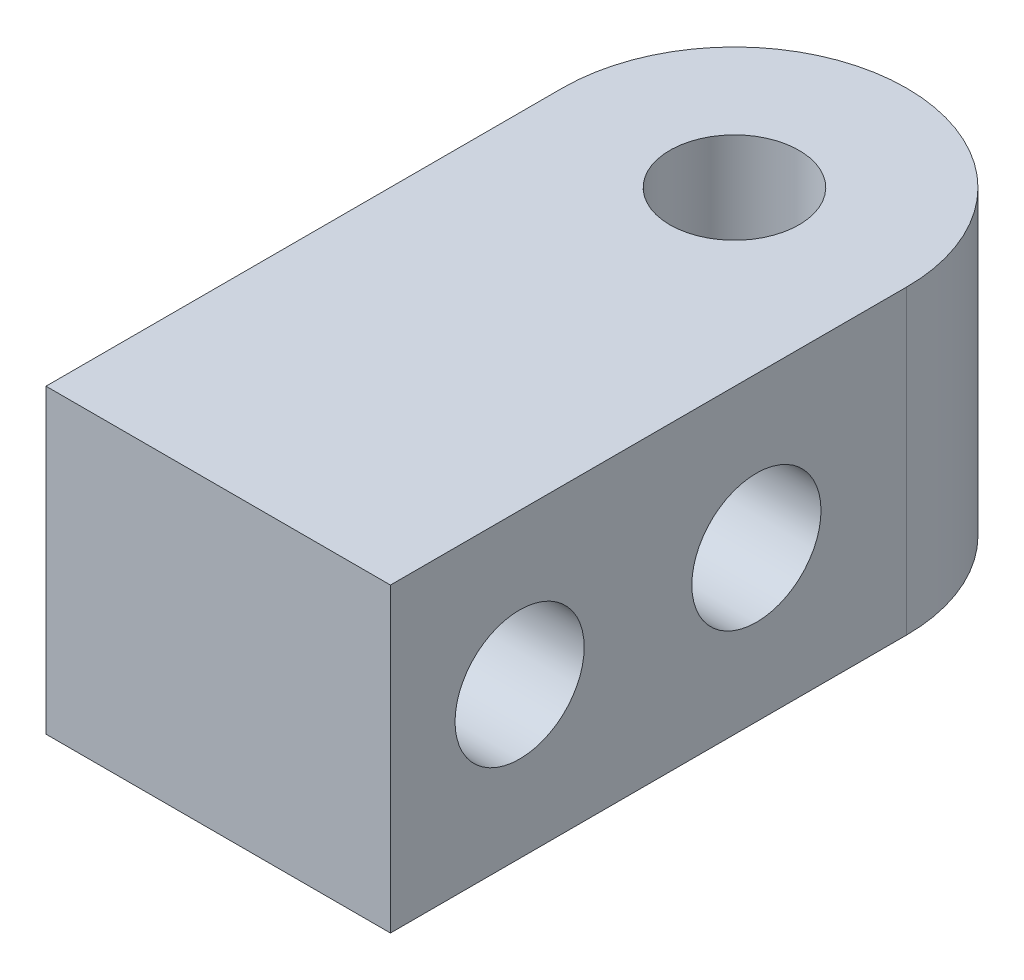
ISO-10303-21;
HEADER;
FILE_DESCRIPTION(('STEP AP214'),'2;1');
FILE_NAME('part.step','',(''),(''),'','','');
FILE_SCHEMA(('AUTOMOTIVE_DESIGN { 1 0 10303 214 1 1 1 1 }'));
ENDSEC;
DATA;
#1=APPLICATION_CONTEXT('core data for automotive mechanical design processes');
#2=APPLICATION_PROTOCOL_DEFINITION('international standard','automotive_design',2000,#1);
#3=PRODUCT_CONTEXT('',#1,'mechanical');
#4=PRODUCT('Part','Part','',(#3));
#5=PRODUCT_RELATED_PRODUCT_CATEGORY('part','',(#4));
#6=PRODUCT_DEFINITION_FORMATION('','',#4);
#7=PRODUCT_DEFINITION_CONTEXT('part definition',#1,'design');
#8=PRODUCT_DEFINITION('design','',#6,#7);
#9=PRODUCT_DEFINITION_SHAPE('','',#8);
#10=(LENGTH_UNIT() NAMED_UNIT(*) SI_UNIT(.MILLI.,.METRE.));
#11=(NAMED_UNIT(*) PLANE_ANGLE_UNIT() SI_UNIT($,.RADIAN.));
#12=(NAMED_UNIT(*) SI_UNIT($,.STERADIAN.) SOLID_ANGLE_UNIT());
#13=UNCERTAINTY_MEASURE_WITH_UNIT(LENGTH_MEASURE(1.E-05),#10,'distance_accuracy_value','');
#14=(GEOMETRIC_REPRESENTATION_CONTEXT(3) GLOBAL_UNCERTAINTY_ASSIGNED_CONTEXT((#13)) GLOBAL_UNIT_ASSIGNED_CONTEXT((#10,
#11,#12)) REPRESENTATION_CONTEXT('',''));
#15=CARTESIAN_POINT('',(0.,0.,0.));
#16=DIRECTION('',(0.,0.,1.));
#17=DIRECTION('',(1.,0.,0.));
#18=AXIS2_PLACEMENT_3D('',#15,#16,#17);
#19=CARTESIAN_POINT('',(4.,7.,0.));
#20=DIRECTION('',(1.,0.,0.));
#21=DIRECTION('',(0.,0.,-1.));
#22=AXIS2_PLACEMENT_3D('',#19,#20,#21);
#23=PLANE('',#22);
#24=CARTESIAN_POINT('',(4.,3.5,3.48966201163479));
#25=DIRECTION('',(1.,0.,0.));
#26=DIRECTION('',(0.,0.,-1.));
#27=AXIS2_PLACEMENT_3D('',#24,#25,#26);
#28=CIRCLE('',#27,1.5);
#29=CARTESIAN_POINT('',(4.,3.5,1.98966201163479));
#30=VERTEX_POINT('',#29);
#31=EDGE_CURVE('E104',#30,#30,#28,.T.);
#32=ORIENTED_EDGE('',*,*,#31,.F.);
#33=EDGE_LOOP('',(#32));
#34=FACE_BOUND('',#33,.T.);
#35=CARTESIAN_POINT('',(4.,3.5,8.98966201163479));
#36=DIRECTION('',(1.,0.,0.));
#37=DIRECTION('',(0.,0.,-1.));
#38=AXIS2_PLACEMENT_3D('',#35,#36,#37);
#39=CIRCLE('',#38,1.5);
#40=CARTESIAN_POINT('',(4.,3.5,7.48966201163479));
#41=VERTEX_POINT('',#40);
#42=EDGE_CURVE('E129',#41,#41,#39,.T.);
#43=ORIENTED_EDGE('',*,*,#42,.F.);
#44=EDGE_LOOP('',(#43));
#45=FACE_BOUND('',#44,.T.);
#46=DIRECTION('',(0.,0.,1.));
#47=VECTOR('',#46,1.);
#48=CARTESIAN_POINT('',(4.,0.,0.));
#49=LINE('',#48,#47);
#50=CARTESIAN_POINT('',(4.,0.,0.));
#51=VERTEX_POINT('',#50);
#52=CARTESIAN_POINT('',(4.,0.,11.9896620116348));
#53=VERTEX_POINT('',#52);
#54=EDGE_CURVE('E101',#51,#53,#49,.T.);
#55=ORIENTED_EDGE('',*,*,#54,.F.);
#56=DIRECTION('',(0.,-1.,0.));
#57=VECTOR('',#56,1.);
#58=CARTESIAN_POINT('',(4.,7.,0.));
#59=LINE('',#58,#57);
#60=CARTESIAN_POINT('',(4.,7.,0.));
#61=VERTEX_POINT('',#60);
#62=EDGE_CURVE('E11',#61,#51,#59,.T.);
#63=ORIENTED_EDGE('',*,*,#62,.F.);
#64=DIRECTION('',(0.,0.,1.));
#65=VECTOR('',#64,1.);
#66=CARTESIAN_POINT('',(4.,7.,0.));
#67=LINE('',#66,#65);
#68=CARTESIAN_POINT('',(4.,7.,11.9896620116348));
#69=VERTEX_POINT('',#68);
#70=EDGE_CURVE('E86',#61,#69,#67,.T.);
#71=ORIENTED_EDGE('',*,*,#70,.T.);
#72=DIRECTION('',(0.,-1.,0.));
#73=VECTOR('',#72,1.);
#74=CARTESIAN_POINT('',(4.,7.,11.9896620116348));
#75=LINE('',#74,#73);
#76=EDGE_CURVE('E74',#69,#53,#75,.T.);
#77=ORIENTED_EDGE('',*,*,#76,.T.);
#78=EDGE_LOOP('',(#55,#63,#71,#77));
#79=FACE_BOUND('',#78,.T.);
#80=ADVANCED_FACE('F35',(#34,#45,#79),#23,.T.);
#81=CARTESIAN_POINT('',(0.,7.,0.));
#82=DIRECTION('',(0.,-1.,0.));
#83=DIRECTION('',(0.,0.,-1.));
#84=AXIS2_PLACEMENT_3D('',#81,#82,#83);
#85=CYLINDRICAL_SURFACE('',#84,4.);
#86=CARTESIAN_POINT('',(0.,0.,0.));
#87=DIRECTION('',(0.,1.,0.));
#88=DIRECTION('',(0.,0.,1.));
#89=AXIS2_PLACEMENT_3D('',#86,#87,#88);
#90=CIRCLE('',#89,4.);
#91=CARTESIAN_POINT('',(-3.99998664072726,0.,-0.0103379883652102));
#92=VERTEX_POINT('',#91);
#93=EDGE_CURVE('E91',#51,#92,#90,.T.);
#94=ORIENTED_EDGE('',*,*,#93,.T.);
#95=DIRECTION('',(0.,-1.,0.));
#96=VECTOR('',#95,1.);
#97=CARTESIAN_POINT('',(-3.99998664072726,7.,-0.0103379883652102));
#98=LINE('',#97,#96);
#99=CARTESIAN_POINT('',(-3.99998664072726,7.,-0.0103379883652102));
#100=VERTEX_POINT('',#99);
#101=EDGE_CURVE('E43',#100,#92,#98,.T.);
#102=ORIENTED_EDGE('',*,*,#101,.F.);
#103=CARTESIAN_POINT('',(0.,7.,0.));
#104=DIRECTION('',(0.,1.,0.));
#105=DIRECTION('',(0.,0.,1.));
#106=AXIS2_PLACEMENT_3D('',#103,#104,#105);
#107=CIRCLE('',#106,4.);
#108=EDGE_CURVE('E80',#61,#100,#107,.T.);
#109=ORIENTED_EDGE('',*,*,#108,.F.);
#110=ORIENTED_EDGE('',*,*,#62,.T.);
#111=EDGE_LOOP('',(#94,#102,#109,#110));
#112=FACE_BOUND('',#111,.T.);
#113=ADVANCED_FACE('F89',(#112),#85,.T.);
#114=CARTESIAN_POINT('',(-3.99998664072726,7.,0.));
#115=DIRECTION('',(1.,0.,0.));
#116=DIRECTION('',(0.,0.,-1.));
#117=AXIS2_PLACEMENT_3D('',#114,#115,#116);
#118=PLANE('',#117);
#119=CARTESIAN_POINT('',(-3.99998664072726,3.5,3.48966201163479));
#120=DIRECTION('',(-1.,0.,0.));
#121=DIRECTION('',(0.,0.,1.));
#122=AXIS2_PLACEMENT_3D('',#119,#120,#121);
#123=CIRCLE('',#122,1.5);
#124=CARTESIAN_POINT('',(-3.99998664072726,3.5,4.98966201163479));
#125=VERTEX_POINT('',#124);
#126=EDGE_CURVE('E131',#125,#125,#123,.T.);
#127=ORIENTED_EDGE('',*,*,#126,.F.);
#128=EDGE_LOOP('',(#127));
#129=FACE_BOUND('',#128,.T.);
#130=CARTESIAN_POINT('',(-3.99998664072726,3.5,8.98966201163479));
#131=DIRECTION('',(-1.,0.,0.));
#132=DIRECTION('',(0.,0.,1.));
#133=AXIS2_PLACEMENT_3D('',#130,#131,#132);
#134=CIRCLE('',#133,1.5);
#135=CARTESIAN_POINT('',(-3.99998664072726,3.5,10.4896620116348));
#136=VERTEX_POINT('',#135);
#137=EDGE_CURVE('E135',#136,#136,#134,.T.);
#138=ORIENTED_EDGE('',*,*,#137,.F.);
#139=EDGE_LOOP('',(#138));
#140=FACE_BOUND('',#139,.T.);
#141=DIRECTION('',(0.,0.,1.));
#142=VECTOR('',#141,1.);
#143=CARTESIAN_POINT('',(-3.99998664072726,0.,0.));
#144=LINE('',#143,#142);
#145=CARTESIAN_POINT('',(-3.99998664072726,0.,11.9896620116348));
#146=VERTEX_POINT('',#145);
#147=EDGE_CURVE('E67',#92,#146,#144,.T.);
#148=ORIENTED_EDGE('',*,*,#147,.T.);
#149=DIRECTION('',(0.,-1.,0.));
#150=VECTOR('',#149,1.);
#151=CARTESIAN_POINT('',(-3.99998664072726,7.,11.9896620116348));
#152=LINE('',#151,#150);
#153=CARTESIAN_POINT('',(-3.99998664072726,7.,11.9896620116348));
#154=VERTEX_POINT('',#153);
#155=EDGE_CURVE('E92',#154,#146,#152,.T.);
#156=ORIENTED_EDGE('',*,*,#155,.F.);
#157=DIRECTION('',(0.,0.,1.));
#158=VECTOR('',#157,1.);
#159=CARTESIAN_POINT('',(-3.99998664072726,7.,0.));
#160=LINE('',#159,#158);
#161=EDGE_CURVE('E85',#100,#154,#160,.T.);
#162=ORIENTED_EDGE('',*,*,#161,.F.);
#163=ORIENTED_EDGE('',*,*,#101,.T.);
#164=EDGE_LOOP('',(#148,#156,#162,#163));
#165=FACE_BOUND('',#164,.T.);
#166=ADVANCED_FACE('F93',(#129,#140,#165),#118,.F.);
#167=CARTESIAN_POINT('',(0.,7.,11.9896620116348));
#168=DIRECTION('',(0.,0.,-1.));
#169=DIRECTION('',(-1.,0.,0.));
#170=AXIS2_PLACEMENT_3D('',#167,#168,#169);
#171=PLANE('',#170);
#172=DIRECTION('',(1.,0.,0.));
#173=VECTOR('',#172,1.);
#174=CARTESIAN_POINT('',(0.,0.,11.9896620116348));
#175=LINE('',#174,#173);
#176=EDGE_CURVE('E107',#146,#53,#175,.T.);
#177=ORIENTED_EDGE('',*,*,#176,.T.);
#178=ORIENTED_EDGE('',*,*,#76,.F.);
#179=DIRECTION('',(1.,0.,0.));
#180=VECTOR('',#179,1.);
#181=CARTESIAN_POINT('',(0.,7.,11.9896620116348));
#182=LINE('',#181,#180);
#183=EDGE_CURVE('E51',#154,#69,#182,.T.);
#184=ORIENTED_EDGE('',*,*,#183,.F.);
#185=ORIENTED_EDGE('',*,*,#155,.T.);
#186=EDGE_LOOP('',(#177,#178,#184,#185));
#187=FACE_BOUND('',#186,.T.);
#188=ADVANCED_FACE('F115',(#187),#171,.F.);
#189=CARTESIAN_POINT('',(0.,7.,0.));
#190=DIRECTION('',(0.,-1.,0.));
#191=DIRECTION('',(0.,0.,-1.));
#192=AXIS2_PLACEMENT_3D('',#189,#190,#191);
#193=CYLINDRICAL_SURFACE('',#192,1.5);
#194=CARTESIAN_POINT('',(0.,7.,0.));
#195=DIRECTION('',(0.,1.,0.));
#196=DIRECTION('',(0.,0.,1.));
#197=AXIS2_PLACEMENT_3D('',#194,#195,#196);
#198=CIRCLE('',#197,1.5);
#199=CARTESIAN_POINT('',(0.,7.,1.5));
#200=VERTEX_POINT('',#199);
#201=EDGE_CURVE('E95',#200,#200,#198,.T.);
#202=ORIENTED_EDGE('',*,*,#201,.T.);
#203=EDGE_LOOP('',(#202));
#204=FACE_BOUND('',#203,.T.);
#205=CARTESIAN_POINT('',(0.,0.,0.));
#206=DIRECTION('',(0.,1.,0.));
#207=DIRECTION('',(0.,0.,1.));
#208=AXIS2_PLACEMENT_3D('',#205,#206,#207);
#209=CIRCLE('',#208,1.5);
#210=CARTESIAN_POINT('',(0.,0.,1.5));
#211=VERTEX_POINT('',#210);
#212=EDGE_CURVE('E109',#211,#211,#209,.T.);
#213=ORIENTED_EDGE('',*,*,#212,.F.);
#214=EDGE_LOOP('',(#213));
#215=FACE_BOUND('',#214,.T.);
#216=ADVANCED_FACE('F149',(#204,#215),#193,.F.);
#217=CARTESIAN_POINT('',(0.,7.,0.));
#218=DIRECTION('',(0.,1.,0.));
#219=DIRECTION('',(0.,0.,1.));
#220=AXIS2_PLACEMENT_3D('',#217,#218,#219);
#221=PLANE('',#220);
#222=ORIENTED_EDGE('',*,*,#70,.F.);
#223=ORIENTED_EDGE('',*,*,#108,.T.);
#224=ORIENTED_EDGE('',*,*,#161,.T.);
#225=ORIENTED_EDGE('',*,*,#183,.T.);
#226=EDGE_LOOP('',(#222,#223,#224,#225));
#227=FACE_BOUND('',#226,.T.);
#228=ORIENTED_EDGE('',*,*,#201,.F.);
#229=EDGE_LOOP('',(#228));
#230=FACE_BOUND('',#229,.T.);
#231=ADVANCED_FACE('F82',(#227,#230),#221,.T.);
#232=CARTESIAN_POINT('',(0.,0.,0.));
#233=DIRECTION('',(0.,1.,0.));
#234=DIRECTION('',(0.,0.,1.));
#235=AXIS2_PLACEMENT_3D('',#232,#233,#234);
#236=PLANE('',#235);
#237=ORIENTED_EDGE('',*,*,#54,.T.);
#238=ORIENTED_EDGE('',*,*,#176,.F.);
#239=ORIENTED_EDGE('',*,*,#147,.F.);
#240=ORIENTED_EDGE('',*,*,#93,.F.);
#241=EDGE_LOOP('',(#237,#238,#239,#240));
#242=FACE_BOUND('',#241,.T.);
#243=ORIENTED_EDGE('',*,*,#212,.T.);
#244=EDGE_LOOP('',(#243));
#245=FACE_BOUND('',#244,.T.);
#246=ADVANCED_FACE('F117',(#242,#245),#236,.F.);
#247=CARTESIAN_POINT('',(14.0000133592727,3.5,8.98966201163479));
#248=DIRECTION('',(-1.,0.,0.));
#249=DIRECTION('',(0.,0.,1.));
#250=AXIS2_PLACEMENT_3D('',#247,#248,#249);
#251=CYLINDRICAL_SURFACE('',#250,1.5);
#252=ORIENTED_EDGE('',*,*,#42,.T.);
#253=EDGE_LOOP('',(#252));
#254=FACE_BOUND('',#253,.T.);
#255=ORIENTED_EDGE('',*,*,#137,.T.);
#256=EDGE_LOOP('',(#255));
#257=FACE_BOUND('',#256,.T.);
#258=ADVANCED_FACE('F141',(#254,#257),#251,.F.);
#259=CARTESIAN_POINT('',(14.0000133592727,3.5,3.48966201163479));
#260=DIRECTION('',(-1.,0.,0.));
#261=DIRECTION('',(0.,0.,1.));
#262=AXIS2_PLACEMENT_3D('',#259,#260,#261);
#263=CYLINDRICAL_SURFACE('',#262,1.5);
#264=ORIENTED_EDGE('',*,*,#31,.T.);
#265=EDGE_LOOP('',(#264));
#266=FACE_BOUND('',#265,.T.);
#267=ORIENTED_EDGE('',*,*,#126,.T.);
#268=EDGE_LOOP('',(#267));
#269=FACE_BOUND('',#268,.T.);
#270=ADVANCED_FACE('F162',(#266,#269),#263,.F.);
#271=CLOSED_SHELL('',(#80,#113,#166,#188,#216,#231,#246,#258,#270));
#272=MANIFOLD_SOLID_BREP('B2',#271);
#273=ADVANCED_BREP_SHAPE_REPRESENTATION('',(#18,#272),#14);
#274=SHAPE_DEFINITION_REPRESENTATION(#9,#273);
ENDSEC;
END-ISO-10303-21;
